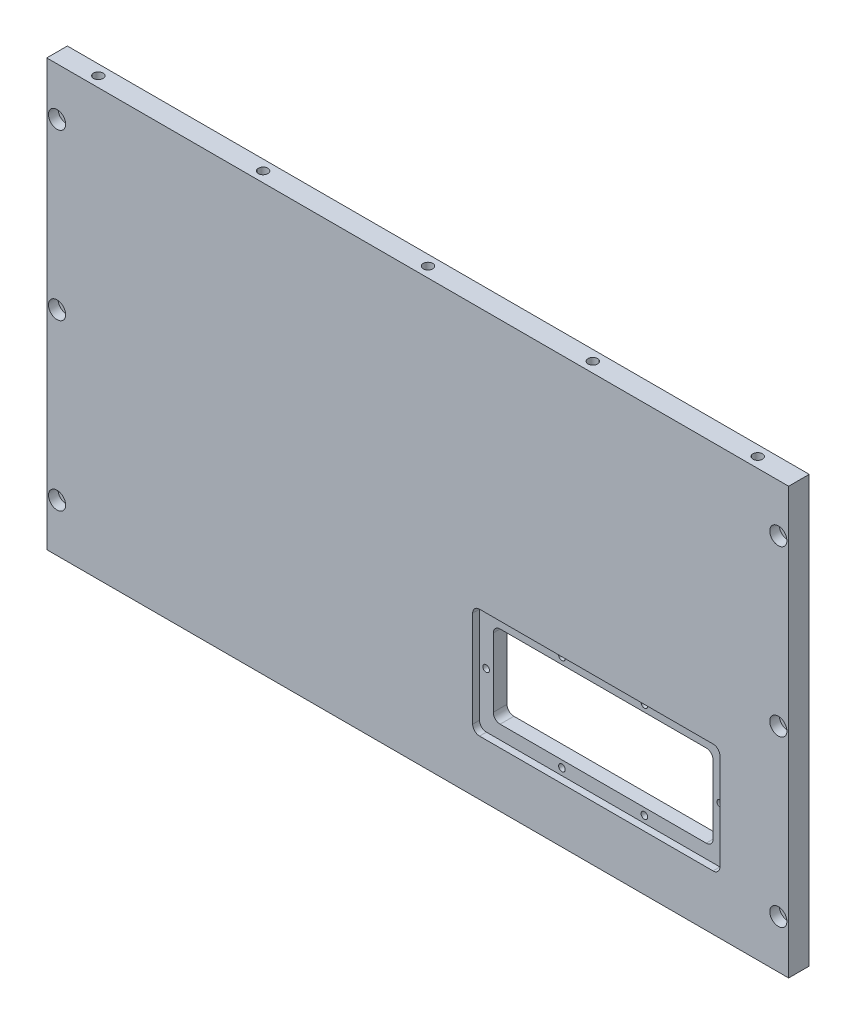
from build123d import *

# Parameters (mm, degrees)
SKETCH1_W                                           = 342.9
SKETCH1_H                                           = 196.85
BOSS_EXTRUDE1_DEPTH                                 = 9.525
CUT_EXTRUDE1_DEPTH                                  = 198.922481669
CUT_EXTRUDE2_DEPTH                                  = 3.175
SKETCH4_R                                           = 1.524
CUT_EXTRUDE3_DEPTH                                  = 198.795110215
SKETCH6_R                                           = 2.1971
CUT_EXTRUDE4_DEPTH                                  = 15.24
CUT_EXTRUDE5_START                                  = -15.24
SKETCH7_R                                           = 2.1971
CUT_EXTRUDE5_DEPTH                                  = 15.24
CBORE_FOR_8_BINDING_HEAD_MACHINE_SCREW1_D           = 4.3053
CBORE_FOR_8_BINDING_HEAD_MACHINE_SCREW1_CBORE_D     = 7.9375
CBORE_FOR_8_BINDING_HEAD_MACHINE_SCREW1_CBORE_DEPTH = 4.4196


with BuildPart() as part:
    # Sketch1 → Boss-Extrude1 (new body)
    with BuildSketch(Plane.XY):
        Rectangle(SKETCH1_W, SKETCH1_H)
    extrude(amount=BOSS_EXTRUDE1_DEPTH)

    # Sketch2 → Cut-Extrude1 (cut, through all)
    with BuildSketch(Plane.XY.offset(9.525)):
        with BuildLine():
            Line((34.925, -28.575), (130.175, -28.575))
            ThreePointArc((130.175, -28.575), (132.42006403, -29.50493597), (133.35, -31.75))
            Line((133.35, -31.75), (133.35, -63.5))
            ThreePointArc((133.35, -63.5), (132.42006403, -65.74506403), (130.175, -66.675))
            Line((130.175, -66.675), (34.925, -66.675))
            ThreePointArc((34.925, -66.675), (32.67993597, -65.74506403), (31.75, -63.5))
            Line((31.75, -63.5), (31.75, -31.75))
            ThreePointArc((31.75, -31.75), (32.67993597, -29.50493597), (34.925, -28.575))
        make_face()
    extrude(amount=-CUT_EXTRUDE1_DEPTH, mode=Mode.SUBTRACT)

    # Sketch3 → Cut-Extrude2 (cut)
    with BuildSketch(Plane.XY.offset(9.525)):
        with BuildLine():
            Line((28.575, -22.225), (136.525, -22.225))
            ThreePointArc((136.525, -22.225), (138.77006403, -23.15493597), (139.7, -25.4))
            Line((139.7, -25.4), (139.7, -69.85))
            ThreePointArc((139.7, -69.85), (138.77006403, -72.09506403), (136.525, -73.025))
            Line((136.525, -73.025), (28.575, -73.025))
            ThreePointArc((28.575, -73.025), (26.32993597, -72.09506403), (25.4, -69.85))
            Line((25.4, -69.85), (25.4, -25.4))
            ThreePointArc((25.4, -25.4), (26.32993597, -23.15493597), (28.575, -22.225))
        make_face()
    extrude(amount=-CUT_EXTRUDE2_DEPTH, mode=Mode.SUBTRACT)

    # Sketch4 → Cut-Extrude3 (cut, through all)
    with BuildSketch(Plane.XY.offset(6.35)):
        with Locations((63.5, -25.4)):
            Circle(SKETCH4_R)
        with Locations((63.5, -69.85)):
            Circle(SKETCH4_R)
        with Locations((101.6, -69.85)):
            Circle(SKETCH4_R)
        with Locations((101.6, -25.4)):
            Circle(SKETCH4_R)
        with Locations((136.652, -47.625)):
            Circle(SKETCH4_R)
        with Locations((28.448, -47.625)):
            Circle(SKETCH4_R)
    extrude(amount=-CUT_EXTRUDE3_DEPTH, mode=Mode.SUBTRACT)

    # Sketch6 → Cut-Extrude4 (cut)
    with BuildSketch(Plane(origin=(0, -98.425, 0), x_dir=(-1, 0, 0), z_dir=(0, -1, 0))):
        with Locations(Location((0, -4.7625, 0), (0, 0, 90))):
            Circle(SKETCH6_R)
        with Locations(Location((76.2, -4.7625, 0), (0, 0, 90))):
            Circle(SKETCH6_R)
        with Locations(Location((152.4, -4.7625, 0), (0, 0, 90))):
            Circle(SKETCH6_R)
        with Locations(Location((-76.2, -4.7625, 0), (0, 0, 90))):
            Circle(SKETCH6_R)
        with Locations(Location((-152.4, -4.7625, 0), (0, 0, 90))):
            Circle(SKETCH6_R)
    extrude(amount=-CUT_EXTRUDE4_DEPTH, mode=Mode.SUBTRACT)

    # Sketch7 → Cut-Extrude5 (cut)
    with BuildSketch(Plane(origin=(0, 98.425, 0), x_dir=(1, 0, 0), z_dir=(0, 1, 0)).offset(CUT_EXTRUDE5_START)):
        with Locations(Location((0, -4.7625, 0), (0, 0, 90))):
            Circle(SKETCH7_R)
        with Locations(Location((76.2, -4.7625, 0), (0, 0, 90))):
            Circle(SKETCH7_R)
        with Locations(Location((152.4, -4.7625, 0), (0, 0, 90))):
            Circle(SKETCH7_R)
        with Locations(Location((-76.2, -4.7625, 0), (0, 0, 90))):
            Circle(SKETCH7_R)
        with Locations(Location((-152.4, -4.7625, 0), (0, 0, 90))):
            Circle(SKETCH7_R)
    extrude(amount=CUT_EXTRUDE5_DEPTH, mode=Mode.SUBTRACT)

    # CBORE for _8 Binding Head Machine Screw1 (through all)
    with Locations(Plane.XY.offset(9.525)):
        with Locations((-166.6875, 76.2), (-166.6875, 0), (-166.6875, -76.2), (166.6875, 76.2), (166.6875, 0), (166.6875, -76.2)):
            CounterBoreHole(CBORE_FOR_8_BINDING_HEAD_MACHINE_SCREW1_D / 2, CBORE_FOR_8_BINDING_HEAD_MACHINE_SCREW1_CBORE_D / 2, CBORE_FOR_8_BINDING_HEAD_MACHINE_SCREW1_CBORE_DEPTH)


solid = part.part
